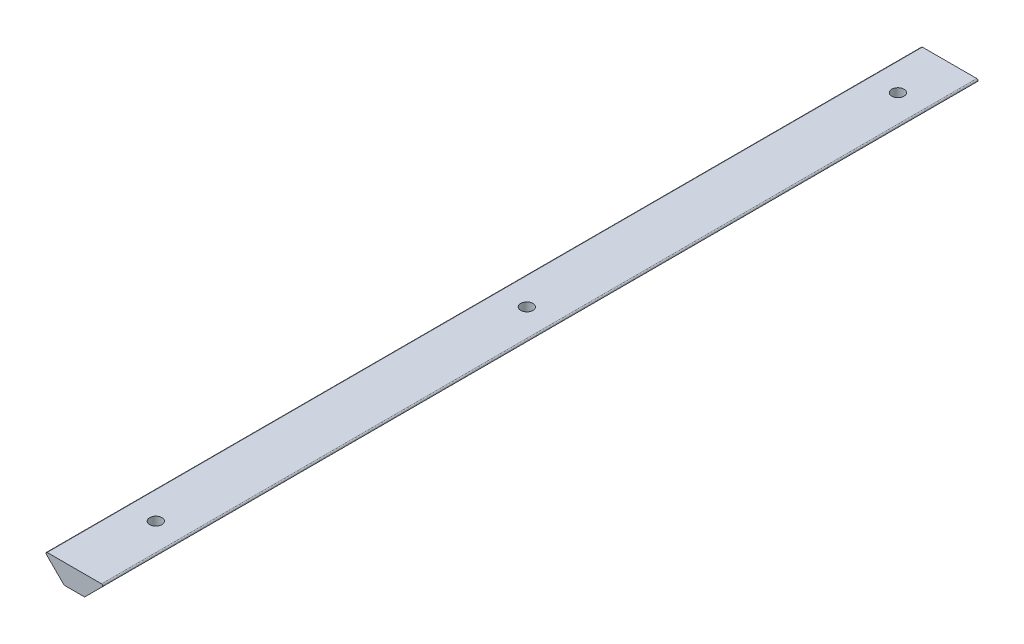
from build123d import *

# Parameters (mm, degrees)
BOSS_EXTRUDE1_DEPTH = 215
SKETCH5_R           = 1.5
CUT_EXTRUDE1_DEPTH  = 30.226
LPATTERN1_COUNT     = 3
LPATTERN1_PITCH     = 91.15


with BuildPart() as part:
    # Sketch1 → Boss-Extrude1 (new body)
    with BuildSketch(Plane.XY):
        with BuildLine():
            Line((2.516497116, 3.86), (6.88370491, 8.227207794))
            ThreePointArc((6.88370491, 8.227207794), (6.948736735, 8.554144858), (6.671572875, 8.739339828))
            Line((6.671572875, 8.739339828), (2.88, 8.739339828))
            Line((2.88, 8.739339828), (-6.671572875, 8.739339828))
            ThreePointArc((-6.671572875, 8.739339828), (-6.948736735, 8.554144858), (-6.88370491, 8.227207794))
            Line((-6.88370491, 8.227207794), (-2.516497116, 3.86))
            Line((-2.516497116, 3.86), (2.516497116, 3.86))
        make_face()
    extrude(amount=-BOSS_EXTRUDE1_DEPTH)

    # Sketch5 → Cut-Extrude1 (cut)
    with BuildSketch(Plane(origin=(0, 8.739339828, 0), x_dir=(1, 0, 0), z_dir=(0, 1, 0))):
        with Locations(Location((0, 20, 0), (0, 0, 180))):
            Circle(SKETCH5_R)
    cut_extrude1 = extrude(amount=-CUT_EXTRUDE1_DEPTH, mode=Mode.SUBTRACT)

    # LPattern1: Cut-Extrude1 ×3
    with Locations(*[(0, 0, -i * LPATTERN1_PITCH) for i in range(1, LPATTERN1_COUNT)]):
        add(cut_extrude1, mode=Mode.SUBTRACT)


solid = part.part
